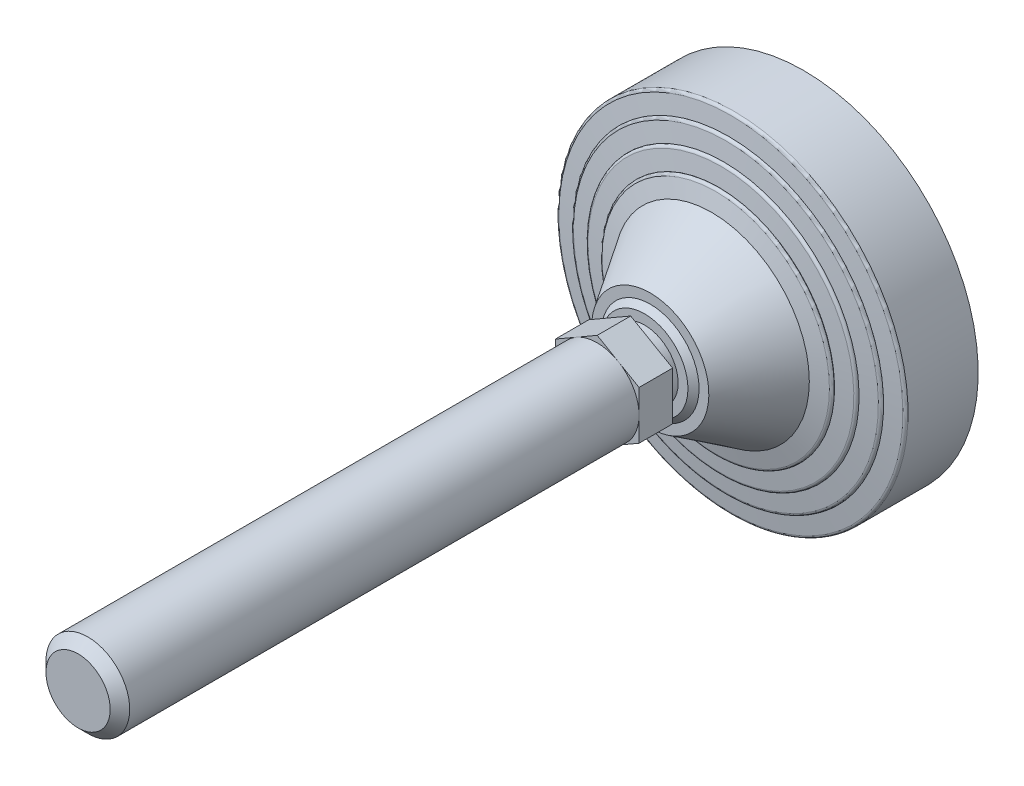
ISO-10303-21;
HEADER;
FILE_DESCRIPTION(('STEP AP214'),'2;1');
FILE_NAME('part.step','',(''),(''),'','','');
FILE_SCHEMA(('AUTOMOTIVE_DESIGN { 1 0 10303 214 1 1 1 1 }'));
ENDSEC;
DATA;
#1=APPLICATION_CONTEXT('core data for automotive mechanical design processes');
#2=APPLICATION_PROTOCOL_DEFINITION('international standard','automotive_design',2000,#1);
#3=PRODUCT_CONTEXT('',#1,'mechanical');
#4=PRODUCT('Part','Part','',(#3));
#5=PRODUCT_RELATED_PRODUCT_CATEGORY('part','',(#4));
#6=PRODUCT_DEFINITION_FORMATION('','',#4);
#7=PRODUCT_DEFINITION_CONTEXT('part definition',#1,'design');
#8=PRODUCT_DEFINITION('design','',#6,#7);
#9=PRODUCT_DEFINITION_SHAPE('','',#8);
#10=(LENGTH_UNIT() NAMED_UNIT(*) SI_UNIT(.MILLI.,.METRE.));
#11=(NAMED_UNIT(*) PLANE_ANGLE_UNIT() SI_UNIT($,.RADIAN.));
#12=(NAMED_UNIT(*) SI_UNIT($,.STERADIAN.) SOLID_ANGLE_UNIT());
#13=UNCERTAINTY_MEASURE_WITH_UNIT(LENGTH_MEASURE(1.E-05),#10,'distance_accuracy_value','');
#14=(GEOMETRIC_REPRESENTATION_CONTEXT(3) GLOBAL_UNCERTAINTY_ASSIGNED_CONTEXT((#13)) GLOBAL_UNIT_ASSIGNED_CONTEXT((#10,
#11,#12)) REPRESENTATION_CONTEXT('',''));
#15=CARTESIAN_POINT('',(0.,0.,0.));
#16=DIRECTION('',(0.,0.,1.));
#17=DIRECTION('',(1.,0.,0.));
#18=AXIS2_PLACEMENT_3D('',#15,#16,#17);
#19=CARTESIAN_POINT('',(-11.9999999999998,0.,62.0000000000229));
#20=DIRECTION('',(0.,0.,1.));
#21=DIRECTION('',(0.,-1.,0.));
#22=AXIS2_PLACEMENT_3D('',#19,#20,#21);
#23=PLANE('',#22);
#24=CARTESIAN_POINT('',(0.,0.,62.0000000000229));
#25=DIRECTION('',(0.,0.,-1.));
#26=DIRECTION('',(0.,1.,0.));
#27=AXIS2_PLACEMENT_3D('',#24,#25,#26);
#28=CIRCLE('',#27,11.9999999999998);
#29=CARTESIAN_POINT('',(0.,11.9999999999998,62.0000000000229));
#30=VERTEX_POINT('',#29);
#31=EDGE_CURVE('E199',#30,#30,#28,.T.);
#32=ORIENTED_EDGE('',*,*,#31,.F.);
#33=EDGE_LOOP('',(#32));
#34=FACE_BOUND('',#33,.T.);
#35=DIRECTION('',(0.866025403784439,0.5,0.));
#36=VECTOR('',#35,1.);
#37=CARTESIAN_POINT('',(-15.,8.6602540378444,62.0000000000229));
#38=LINE('',#37,#36);
#39=CARTESIAN_POINT('',(-15.,8.6602540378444,62.0000000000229));
#40=VERTEX_POINT('',#39);
#41=CARTESIAN_POINT('',(0.,17.3205080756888,62.0000000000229));
#42=VERTEX_POINT('',#41);
#43=EDGE_CURVE('E87',#40,#42,#38,.T.);
#44=ORIENTED_EDGE('',*,*,#43,.T.);
#45=DIRECTION('',(0.866025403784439,-0.5,0.));
#46=VECTOR('',#45,1.);
#47=CARTESIAN_POINT('',(0.,17.3205080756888,62.0000000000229));
#48=LINE('',#47,#46);
#49=CARTESIAN_POINT('',(15.,8.66025403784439,62.0000000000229));
#50=VERTEX_POINT('',#49);
#51=EDGE_CURVE('E99',#42,#50,#48,.T.);
#52=ORIENTED_EDGE('',*,*,#51,.T.);
#53=DIRECTION('',(0.,-1.,0.));
#54=VECTOR('',#53,1.);
#55=CARTESIAN_POINT('',(15.,8.66025403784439,62.0000000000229));
#56=LINE('',#55,#54);
#57=CARTESIAN_POINT('',(15.,-8.66025403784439,62.0000000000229));
#58=VERTEX_POINT('',#57);
#59=EDGE_CURVE('E105',#50,#58,#56,.T.);
#60=ORIENTED_EDGE('',*,*,#59,.T.);
#61=DIRECTION('',(-0.866025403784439,-0.5,0.));
#62=VECTOR('',#61,1.);
#63=CARTESIAN_POINT('',(15.,-8.66025403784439,62.0000000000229));
#64=LINE('',#63,#62);
#65=CARTESIAN_POINT('',(0.,-17.3205080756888,62.0000000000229));
#66=VERTEX_POINT('',#65);
#67=EDGE_CURVE('E113',#58,#66,#64,.T.);
#68=ORIENTED_EDGE('',*,*,#67,.T.);
#69=DIRECTION('',(-0.866025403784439,0.5,0.));
#70=VECTOR('',#69,1.);
#71=CARTESIAN_POINT('',(0.,-17.3205080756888,62.0000000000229));
#72=LINE('',#71,#70);
#73=CARTESIAN_POINT('',(-15.,-8.66025403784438,62.0000000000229));
#74=VERTEX_POINT('',#73);
#75=EDGE_CURVE('E116',#66,#74,#72,.T.);
#76=ORIENTED_EDGE('',*,*,#75,.T.);
#77=DIRECTION('',(0.,1.,0.));
#78=VECTOR('',#77,1.);
#79=CARTESIAN_POINT('',(-15.,-8.66025403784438,62.0000000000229));
#80=LINE('',#79,#78);
#81=EDGE_CURVE('E109',#74,#40,#80,.T.);
#82=ORIENTED_EDGE('',*,*,#81,.T.);
#83=EDGE_LOOP('',(#44,#52,#60,#68,#76,#82));
#84=FACE_BOUND('',#83,.T.);
#85=ADVANCED_FACE('F14',(#34,#84),#23,.F.);
#86=CARTESIAN_POINT('',(0.,0.,0.));
#87=DIRECTION('',(0.,0.,-1.));
#88=DIRECTION('',(0.,1.,0.));
#89=AXIS2_PLACEMENT_3D('',#86,#87,#88);
#90=CYLINDRICAL_SURFACE('',#89,11.9999999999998);
#91=CARTESIAN_POINT('',(0.,0.,57.));
#92=DIRECTION('',(0.,0.,-1.));
#93=DIRECTION('',(0.,1.,0.));
#94=AXIS2_PLACEMENT_3D('',#91,#92,#93);
#95=CIRCLE('',#94,11.9999999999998);
#96=CARTESIAN_POINT('',(0.,11.9999999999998,57.));
#97=VERTEX_POINT('',#96);
#98=EDGE_CURVE('E196',#97,#97,#95,.T.);
#99=ORIENTED_EDGE('',*,*,#98,.F.);
#100=EDGE_LOOP('',(#99));
#101=FACE_BOUND('',#100,.T.);
#102=ORIENTED_EDGE('',*,*,#31,.T.);
#103=EDGE_LOOP('',(#102));
#104=FACE_BOUND('',#103,.T.);
#105=ADVANCED_FACE('F252',(#101,#104),#90,.T.);
#106=CARTESIAN_POINT('',(-11.9999999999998,0.,57.));
#107=DIRECTION('',(0.,0.,-1.));
#108=DIRECTION('',(0.,1.,0.));
#109=AXIS2_PLACEMENT_3D('',#106,#107,#108);
#110=PLANE('',#109);
#111=CARTESIAN_POINT('',(0.,0.,57.));
#112=DIRECTION('',(0.,0.,-1.));
#113=DIRECTION('',(0.,1.,0.));
#114=AXIS2_PLACEMENT_3D('',#111,#112,#113);
#115=CIRCLE('',#114,15.5);
#116=CARTESIAN_POINT('',(0.,15.5,57.));
#117=VERTEX_POINT('',#116);
#118=EDGE_CURVE('E193',#117,#117,#115,.T.);
#119=ORIENTED_EDGE('',*,*,#118,.F.);
#120=EDGE_LOOP('',(#119));
#121=FACE_BOUND('',#120,.T.);
#122=ORIENTED_EDGE('',*,*,#98,.T.);
#123=EDGE_LOOP('',(#122));
#124=FACE_BOUND('',#123,.T.);
#125=ADVANCED_FACE('F258',(#121,#124),#110,.F.);
#126=CARTESIAN_POINT('',(0.,0.,57.));
#127=DIRECTION('',(0.,0.,-1.));
#128=DIRECTION('',(0.,1.,0.));
#129=AXIS2_PLACEMENT_3D('',#126,#127,#128);
#130=CONICAL_SURFACE('',#129,15.5,0.785398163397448);
#131=CARTESIAN_POINT('',(0.,0.,55.));
#132=DIRECTION('',(0.,0.,-1.));
#133=DIRECTION('',(0.,1.,0.));
#134=AXIS2_PLACEMENT_3D('',#131,#132,#133);
#135=CIRCLE('',#134,17.5);
#136=CARTESIAN_POINT('',(0.,17.5,55.));
#137=VERTEX_POINT('',#136);
#138=EDGE_CURVE('E190',#137,#137,#135,.T.);
#139=ORIENTED_EDGE('',*,*,#138,.F.);
#140=EDGE_LOOP('',(#139));
#141=FACE_BOUND('',#140,.T.);
#142=ORIENTED_EDGE('',*,*,#118,.T.);
#143=EDGE_LOOP('',(#142));
#144=FACE_BOUND('',#143,.T.);
#145=ADVANCED_FACE('F265',(#141,#144),#130,.T.);
#146=CARTESIAN_POINT('',(-17.5,0.,55.));
#147=DIRECTION('',(0.,0.,-1.));
#148=DIRECTION('',(0.,1.,0.));
#149=AXIS2_PLACEMENT_3D('',#146,#147,#148);
#150=PLANE('',#149);
#151=CARTESIAN_POINT('',(0.,0.,55.));
#152=DIRECTION('',(0.,0.,-1.));
#153=DIRECTION('',(0.,1.,0.));
#154=AXIS2_PLACEMENT_3D('',#151,#152,#153);
#155=CIRCLE('',#154,20.9999999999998);
#156=CARTESIAN_POINT('',(0.,20.9999999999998,55.));
#157=VERTEX_POINT('',#156);
#158=EDGE_CURVE('E187',#157,#157,#155,.T.);
#159=ORIENTED_EDGE('',*,*,#158,.F.);
#160=EDGE_LOOP('',(#159));
#161=FACE_BOUND('',#160,.T.);
#162=ORIENTED_EDGE('',*,*,#138,.T.);
#163=EDGE_LOOP('',(#162));
#164=FACE_BOUND('',#163,.T.);
#165=ADVANCED_FACE('F269',(#161,#164),#150,.F.);
#166=CARTESIAN_POINT('',(0.,0.,55.));
#167=DIRECTION('',(0.,0.,-1.));
#168=DIRECTION('',(0.,1.,0.));
#169=AXIS2_PLACEMENT_3D('',#166,#167,#168);
#170=CONICAL_SURFACE('',#169,20.9999999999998,0.566729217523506);
#171=CARTESIAN_POINT('',(0.,0.,33.));
#172=DIRECTION('',(0.,0.,-1.));
#173=DIRECTION('',(0.,1.,0.));
#174=AXIS2_PLACEMENT_3D('',#171,#172,#173);
#175=CIRCLE('',#174,35.);
#176=CARTESIAN_POINT('',(0.,35.,33.));
#177=VERTEX_POINT('',#176);
#178=EDGE_CURVE('E184',#177,#177,#175,.T.);
#179=ORIENTED_EDGE('',*,*,#178,.F.);
#180=EDGE_LOOP('',(#179));
#181=FACE_BOUND('',#180,.T.);
#182=ORIENTED_EDGE('',*,*,#158,.T.);
#183=EDGE_LOOP('',(#182));
#184=FACE_BOUND('',#183,.T.);
#185=ADVANCED_FACE('F273',(#181,#184),#170,.T.);
#186=CARTESIAN_POINT('',(0.,0.,33.));
#187=DIRECTION('',(0.,0.,-1.));
#188=DIRECTION('',(0.,1.,0.));
#189=AXIS2_PLACEMENT_3D('',#186,#187,#188);
#190=CONICAL_SURFACE('',#189,35.,1.32154418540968);
#191=CARTESIAN_POINT('',(0.,0.,31.5372089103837));
#192=DIRECTION('',(0.,0.,-1.));
#193=DIRECTION('',(0.,1.,0.));
#194=AXIS2_PLACEMENT_3D('',#191,#192,#193);
#195=CIRCLE('',#194,40.7466792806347);
#196=CARTESIAN_POINT('',(0.,40.7466792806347,31.5372089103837));
#197=VERTEX_POINT('',#196);
#198=EDGE_CURVE('E181',#197,#197,#195,.T.);
#199=ORIENTED_EDGE('',*,*,#198,.F.);
#200=EDGE_LOOP('',(#199));
#201=FACE_BOUND('',#200,.T.);
#202=ORIENTED_EDGE('',*,*,#178,.T.);
#203=EDGE_LOOP('',(#202));
#204=FACE_BOUND('',#203,.T.);
#205=ADVANCED_FACE('F277',(#201,#204),#190,.T.);
#206=CARTESIAN_POINT('',(0.,0.,30.5681117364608));
#207=DIRECTION('',(0.,0.,-1.));
#208=DIRECTION('',(0.,1.,0.));
#209=AXIS2_PLACEMENT_3D('',#206,#207,#208);
#210=TOROIDAL_SURFACE('',#209,40.5,1.);
#211=CARTESIAN_POINT('',(0.,0.,30.5681117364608));
#212=DIRECTION('',(0.,0.,-1.));
#213=DIRECTION('',(0.,1.,0.));
#214=AXIS2_PLACEMENT_3D('',#211,#212,#213);
#215=CIRCLE('',#214,41.5);
#216=CARTESIAN_POINT('',(0.,41.5,30.5681117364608));
#217=VERTEX_POINT('',#216);
#218=EDGE_CURVE('E178',#217,#217,#215,.T.);
#219=ORIENTED_EDGE('',*,*,#218,.F.);
#220=EDGE_LOOP('',(#219));
#221=FACE_BOUND('',#220,.T.);
#222=ORIENTED_EDGE('',*,*,#198,.T.);
#223=EDGE_LOOP('',(#222));
#224=FACE_BOUND('',#223,.T.);
#225=ADVANCED_FACE('F281',(#221,#224),#210,.T.);
#226=CARTESIAN_POINT('',(0.,0.,0.));
#227=DIRECTION('',(0.,0.,-1.));
#228=DIRECTION('',(0.,1.,0.));
#229=AXIS2_PLACEMENT_3D('',#226,#227,#228);
#230=CYLINDRICAL_SURFACE('',#229,41.5);
#231=CARTESIAN_POINT('',(0.,0.,30.4545454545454));
#232=DIRECTION('',(0.,0.,-1.));
#233=DIRECTION('',(0.,1.,0.));
#234=AXIS2_PLACEMENT_3D('',#231,#232,#233);
#235=CIRCLE('',#234,41.5);
#236=CARTESIAN_POINT('',(0.,41.5,30.4545454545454));
#237=VERTEX_POINT('',#236);
#238=EDGE_CURVE('E175',#237,#237,#235,.T.);
#239=ORIENTED_EDGE('',*,*,#238,.F.);
#240=EDGE_LOOP('',(#239));
#241=FACE_BOUND('',#240,.T.);
#242=ORIENTED_EDGE('',*,*,#218,.T.);
#243=EDGE_LOOP('',(#242));
#244=FACE_BOUND('',#243,.T.);
#245=ADVANCED_FACE('F285',(#241,#244),#230,.T.);
#246=CARTESIAN_POINT('',(0.,0.,30.4545454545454));
#247=DIRECTION('',(0.,0.,-1.));
#248=DIRECTION('',(0.,1.,0.));
#249=AXIS2_PLACEMENT_3D('',#246,#247,#248);
#250=CONICAL_SURFACE('',#249,41.5,1.44420419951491);
#251=CARTESIAN_POINT('',(0.,0.,29.674840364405));
#252=DIRECTION('',(0.,0.,-1.));
#253=DIRECTION('',(0.,1.,0.));
#254=AXIS2_PLACEMENT_3D('',#251,#252,#253);
#255=CIRCLE('',#254,47.6262542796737);
#256=CARTESIAN_POINT('',(0.,47.6262542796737,29.674840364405));
#257=VERTEX_POINT('',#256);
#258=EDGE_CURVE('E172',#257,#257,#255,.T.);
#259=ORIENTED_EDGE('',*,*,#258,.F.);
#260=EDGE_LOOP('',(#259));
#261=FACE_BOUND('',#260,.T.);
#262=ORIENTED_EDGE('',*,*,#238,.T.);
#263=EDGE_LOOP('',(#262));
#264=FACE_BOUND('',#263,.T.);
#265=ADVANCED_FACE('F289',(#261,#264),#250,.T.);
#266=CARTESIAN_POINT('',(0.,0.,28.6828424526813));
#267=DIRECTION('',(0.,0.,-1.));
#268=DIRECTION('',(0.,1.,0.));
#269=AXIS2_PLACEMENT_3D('',#266,#267,#268);
#270=TOROIDAL_SURFACE('',#269,47.5,1.);
#271=CARTESIAN_POINT('',(0.,0.,28.6828424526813));
#272=DIRECTION('',(0.,0.,-1.));
#273=DIRECTION('',(0.,1.,0.));
#274=AXIS2_PLACEMENT_3D('',#271,#272,#273);
#275=CIRCLE('',#274,48.5);
#276=CARTESIAN_POINT('',(0.,48.5,28.6828424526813));
#277=VERTEX_POINT('',#276);
#278=EDGE_CURVE('E169',#277,#277,#275,.T.);
#279=ORIENTED_EDGE('',*,*,#278,.F.);
#280=EDGE_LOOP('',(#279));
#281=FACE_BOUND('',#280,.T.);
#282=ORIENTED_EDGE('',*,*,#258,.T.);
#283=EDGE_LOOP('',(#282));
#284=FACE_BOUND('',#283,.T.);
#285=ADVANCED_FACE('F293',(#281,#284),#270,.T.);
#286=CARTESIAN_POINT('',(0.,0.,0.));
#287=DIRECTION('',(0.,0.,-1.));
#288=DIRECTION('',(0.,1.,0.));
#289=AXIS2_PLACEMENT_3D('',#286,#287,#288);
#290=CYLINDRICAL_SURFACE('',#289,48.5);
#291=CARTESIAN_POINT('',(0.,0.,28.6727272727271));
#292=DIRECTION('',(0.,0.,-1.));
#293=DIRECTION('',(0.,1.,0.));
#294=AXIS2_PLACEMENT_3D('',#291,#292,#293);
#295=CIRCLE('',#294,48.5);
#296=CARTESIAN_POINT('',(0.,48.5,28.6727272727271));
#297=VERTEX_POINT('',#296);
#298=EDGE_CURVE('E166',#297,#297,#295,.T.);
#299=ORIENTED_EDGE('',*,*,#298,.F.);
#300=EDGE_LOOP('',(#299));
#301=FACE_BOUND('',#300,.T.);
#302=ORIENTED_EDGE('',*,*,#278,.T.);
#303=EDGE_LOOP('',(#302));
#304=FACE_BOUND('',#303,.T.);
#305=ADVANCED_FACE('F297',(#301,#304),#290,.T.);
#306=CARTESIAN_POINT('',(0.,0.,28.6727272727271));
#307=DIRECTION('',(0.,0.,-1.));
#308=DIRECTION('',(0.,1.,0.));
#309=AXIS2_PLACEMENT_3D('',#306,#307,#308);
#310=CONICAL_SURFACE('',#309,48.5,1.44420419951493);
#311=CARTESIAN_POINT('',(0.,0.,27.8930221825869));
#312=DIRECTION('',(0.,0.,-1.));
#313=DIRECTION('',(0.,1.,0.));
#314=AXIS2_PLACEMENT_3D('',#311,#312,#313);
#315=CIRCLE('',#314,54.6262542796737);
#316=CARTESIAN_POINT('',(0.,54.6262542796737,27.8930221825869));
#317=VERTEX_POINT('',#316);
#318=EDGE_CURVE('E163',#317,#317,#315,.T.);
#319=ORIENTED_EDGE('',*,*,#318,.F.);
#320=EDGE_LOOP('',(#319));
#321=FACE_BOUND('',#320,.T.);
#322=ORIENTED_EDGE('',*,*,#298,.T.);
#323=EDGE_LOOP('',(#322));
#324=FACE_BOUND('',#323,.T.);
#325=ADVANCED_FACE('F301',(#321,#324),#310,.T.);
#326=CARTESIAN_POINT('',(0.,0.,26.9010242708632));
#327=DIRECTION('',(0.,0.,-1.));
#328=DIRECTION('',(0.,1.,0.));
#329=AXIS2_PLACEMENT_3D('',#326,#327,#328);
#330=TOROIDAL_SURFACE('',#329,54.5,1.);
#331=CARTESIAN_POINT('',(0.,0.,26.9010242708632));
#332=DIRECTION('',(0.,0.,-1.));
#333=DIRECTION('',(0.,1.,0.));
#334=AXIS2_PLACEMENT_3D('',#331,#332,#333);
#335=CIRCLE('',#334,55.5);
#336=CARTESIAN_POINT('',(0.,55.5,26.9010242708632));
#337=VERTEX_POINT('',#336);
#338=EDGE_CURVE('E160',#337,#337,#335,.T.);
#339=ORIENTED_EDGE('',*,*,#338,.F.);
#340=EDGE_LOOP('',(#339));
#341=FACE_BOUND('',#340,.T.);
#342=ORIENTED_EDGE('',*,*,#318,.T.);
#343=EDGE_LOOP('',(#342));
#344=FACE_BOUND('',#343,.T.);
#345=ADVANCED_FACE('F305',(#341,#344),#330,.T.);
#346=CARTESIAN_POINT('',(0.,0.,0.));
#347=DIRECTION('',(0.,0.,-1.));
#348=DIRECTION('',(0.,1.,0.));
#349=AXIS2_PLACEMENT_3D('',#346,#347,#348);
#350=CYLINDRICAL_SURFACE('',#349,55.5);
#351=CARTESIAN_POINT('',(0.,0.,26.890909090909));
#352=DIRECTION('',(0.,0.,-1.));
#353=DIRECTION('',(0.,1.,0.));
#354=AXIS2_PLACEMENT_3D('',#351,#352,#353);
#355=CIRCLE('',#354,55.5);
#356=CARTESIAN_POINT('',(0.,55.5,26.890909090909));
#357=VERTEX_POINT('',#356);
#358=EDGE_CURVE('E157',#357,#357,#355,.T.);
#359=ORIENTED_EDGE('',*,*,#358,.F.);
#360=EDGE_LOOP('',(#359));
#361=FACE_BOUND('',#360,.T.);
#362=ORIENTED_EDGE('',*,*,#338,.T.);
#363=EDGE_LOOP('',(#362));
#364=FACE_BOUND('',#363,.T.);
#365=ADVANCED_FACE('F309',(#361,#364),#350,.T.);
#366=CARTESIAN_POINT('',(0.,0.,26.890909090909));
#367=DIRECTION('',(0.,0.,-1.));
#368=DIRECTION('',(0.,1.,0.));
#369=AXIS2_PLACEMENT_3D('',#366,#367,#368);
#370=CONICAL_SURFACE('',#369,55.5,1.44420419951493);
#371=CARTESIAN_POINT('',(0.,0.,26.1112040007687));
#372=DIRECTION('',(0.,0.,-1.));
#373=DIRECTION('',(0.,1.,0.));
#374=AXIS2_PLACEMENT_3D('',#371,#372,#373);
#375=CIRCLE('',#374,61.6262542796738);
#376=CARTESIAN_POINT('',(0.,61.6262542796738,26.1112040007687));
#377=VERTEX_POINT('',#376);
#378=EDGE_CURVE('E154',#377,#377,#375,.T.);
#379=ORIENTED_EDGE('',*,*,#378,.F.);
#380=EDGE_LOOP('',(#379));
#381=FACE_BOUND('',#380,.T.);
#382=ORIENTED_EDGE('',*,*,#358,.T.);
#383=EDGE_LOOP('',(#382));
#384=FACE_BOUND('',#383,.T.);
#385=ADVANCED_FACE('F313',(#381,#384),#370,.T.);
#386=CARTESIAN_POINT('',(0.,0.,25.1192060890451));
#387=DIRECTION('',(0.,0.,-1.));
#388=DIRECTION('',(0.,1.,0.));
#389=AXIS2_PLACEMENT_3D('',#386,#387,#388);
#390=TOROIDAL_SURFACE('',#389,61.5,1.);
#391=CARTESIAN_POINT('',(0.,0.,25.1192060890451));
#392=DIRECTION('',(0.,0.,-1.));
#393=DIRECTION('',(0.,1.,0.));
#394=AXIS2_PLACEMENT_3D('',#391,#392,#393);
#395=CIRCLE('',#394,62.5);
#396=CARTESIAN_POINT('',(0.,62.5,25.1192060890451));
#397=VERTEX_POINT('',#396);
#398=EDGE_CURVE('E151',#397,#397,#395,.T.);
#399=ORIENTED_EDGE('',*,*,#398,.F.);
#400=EDGE_LOOP('',(#399));
#401=FACE_BOUND('',#400,.T.);
#402=ORIENTED_EDGE('',*,*,#378,.T.);
#403=EDGE_LOOP('',(#402));
#404=FACE_BOUND('',#403,.T.);
#405=ADVANCED_FACE('F317',(#401,#404),#390,.T.);
#406=CARTESIAN_POINT('',(0.,0.,0.));
#407=DIRECTION('',(0.,0.,-1.));
#408=DIRECTION('',(0.,1.,0.));
#409=AXIS2_PLACEMENT_3D('',#406,#407,#408);
#410=CYLINDRICAL_SURFACE('',#409,62.5);
#411=CARTESIAN_POINT('',(0.,0.,0.));
#412=DIRECTION('',(0.,0.,-1.));
#413=DIRECTION('',(0.,1.,0.));
#414=AXIS2_PLACEMENT_3D('',#411,#412,#413);
#415=CIRCLE('',#414,62.5);
#416=CARTESIAN_POINT('',(0.,62.5,0.));
#417=VERTEX_POINT('',#416);
#418=EDGE_CURVE('E141',#417,#417,#415,.T.);
#419=ORIENTED_EDGE('',*,*,#418,.F.);
#420=EDGE_LOOP('',(#419));
#421=FACE_BOUND('',#420,.T.);
#422=ORIENTED_EDGE('',*,*,#398,.T.);
#423=EDGE_LOOP('',(#422));
#424=FACE_BOUND('',#423,.T.);
#425=ADVANCED_FACE('F321',(#421,#424),#410,.T.);
#426=CARTESIAN_POINT('',(0.,0.,0.));
#427=DIRECTION('',(0.,0.,1.));
#428=DIRECTION('',(0.,-1.,0.));
#429=AXIS2_PLACEMENT_3D('',#426,#427,#428);
#430=PLANE('',#429);
#431=ORIENTED_EDGE('',*,*,#418,.T.);
#432=EDGE_LOOP('',(#431));
#433=FACE_BOUND('',#432,.T.);
#434=ADVANCED_FACE('F325',(#433),#430,.F.);
#435=CARTESIAN_POINT('',(15.,25.9807621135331,74.0000000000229));
#436=DIRECTION('',(0.,0.,-1.));
#437=DIRECTION('',(0.,1.,0.));
#438=AXIS2_PLACEMENT_3D('',#435,#436,#437);
#439=PLANE('',#438);
#440=DIRECTION('',(0.866025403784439,-0.5,0.));
#441=VECTOR('',#440,1.);
#442=CARTESIAN_POINT('',(0.,17.3205080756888,74.0000000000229));
#443=LINE('',#442,#441);
#444=CARTESIAN_POINT('',(7.5,12.9903810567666,74.0000000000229));
#445=VERTEX_POINT('',#444);
#446=CARTESIAN_POINT('',(15.,8.66025403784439,74.0000000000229));
#447=VERTEX_POINT('',#446);
#448=EDGE_CURVE('E121',#445,#447,#443,.T.);
#449=ORIENTED_EDGE('',*,*,#448,.F.);
#450=CARTESIAN_POINT('',(0.,0.,74.0000000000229));
#451=DIRECTION('',(0.,0.,-1.));
#452=DIRECTION('',(0.,1.,0.));
#453=AXIS2_PLACEMENT_3D('',#450,#451,#452);
#454=CIRCLE('',#453,14.9999999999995);
#455=CARTESIAN_POINT('',(15.,0.,74.0000000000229));
#456=VERTEX_POINT('',#455);
#457=EDGE_CURVE('E9',#445,#456,#454,.T.);
#458=ORIENTED_EDGE('',*,*,#457,.T.);
#459=DIRECTION('',(0.,-1.,0.));
#460=VECTOR('',#459,1.);
#461=CARTESIAN_POINT('',(15.,8.66025403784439,74.0000000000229));
#462=LINE('',#461,#460);
#463=EDGE_CURVE('E125',#447,#456,#462,.T.);
#464=ORIENTED_EDGE('',*,*,#463,.F.);
#465=EDGE_LOOP('',(#449,#458,#464));
#466=FACE_BOUND('',#465,.T.);
#467=ADVANCED_FACE('F238',(#466),#439,.F.);
#468=CARTESIAN_POINT('',(15.,-8.66025403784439,74.0000000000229));
#469=VERTEX_POINT('',#468);
#470=EDGE_CURVE('E124',#456,#469,#462,.T.);
#471=ORIENTED_EDGE('',*,*,#470,.F.);
#472=CARTESIAN_POINT('',(7.5,-12.9903810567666,74.0000000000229));
#473=VERTEX_POINT('',#472);
#474=EDGE_CURVE('E23',#456,#473,#454,.T.);
#475=ORIENTED_EDGE('',*,*,#474,.T.);
#476=DIRECTION('',(-0.866025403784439,-0.5,0.));
#477=VECTOR('',#476,1.);
#478=CARTESIAN_POINT('',(15.,-8.66025403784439,74.0000000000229));
#479=LINE('',#478,#477);
#480=EDGE_CURVE('E129',#469,#473,#479,.T.);
#481=ORIENTED_EDGE('',*,*,#480,.F.);
#482=EDGE_LOOP('',(#471,#475,#481));
#483=FACE_BOUND('',#482,.T.);
#484=ADVANCED_FACE('F227',(#483),#439,.F.);
#485=CARTESIAN_POINT('',(0.,-17.3205080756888,74.0000000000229));
#486=VERTEX_POINT('',#485);
#487=EDGE_CURVE('E128',#473,#486,#479,.T.);
#488=ORIENTED_EDGE('',*,*,#487,.F.);
#489=CARTESIAN_POINT('',(-7.5,-12.9903810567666,74.0000000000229));
#490=VERTEX_POINT('',#489);
#491=EDGE_CURVE('E33',#473,#490,#454,.T.);
#492=ORIENTED_EDGE('',*,*,#491,.T.);
#493=DIRECTION('',(-0.866025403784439,0.5,0.));
#494=VECTOR('',#493,1.);
#495=CARTESIAN_POINT('',(0.,-17.3205080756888,74.0000000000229));
#496=LINE('',#495,#494);
#497=EDGE_CURVE('E133',#486,#490,#496,.T.);
#498=ORIENTED_EDGE('',*,*,#497,.F.);
#499=EDGE_LOOP('',(#488,#492,#498));
#500=FACE_BOUND('',#499,.T.);
#501=ADVANCED_FACE('F228',(#500),#439,.F.);
#502=CARTESIAN_POINT('',(-15.,-8.66025403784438,74.0000000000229));
#503=VERTEX_POINT('',#502);
#504=EDGE_CURVE('E132',#490,#503,#496,.T.);
#505=ORIENTED_EDGE('',*,*,#504,.F.);
#506=CARTESIAN_POINT('',(-15.,0.,74.0000000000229));
#507=VERTEX_POINT('',#506);
#508=EDGE_CURVE('E213',#490,#507,#454,.T.);
#509=ORIENTED_EDGE('',*,*,#508,.T.);
#510=DIRECTION('',(0.,1.,0.));
#511=VECTOR('',#510,1.);
#512=CARTESIAN_POINT('',(-15.,-8.66025403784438,74.0000000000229));
#513=LINE('',#512,#511);
#514=EDGE_CURVE('E96',#503,#507,#513,.T.);
#515=ORIENTED_EDGE('',*,*,#514,.F.);
#516=EDGE_LOOP('',(#505,#509,#515));
#517=FACE_BOUND('',#516,.T.);
#518=ADVANCED_FACE('F358',(#517),#439,.F.);
#519=CARTESIAN_POINT('',(-15.,8.6602540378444,74.0000000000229));
#520=VERTEX_POINT('',#519);
#521=EDGE_CURVE('E136',#507,#520,#513,.T.);
#522=ORIENTED_EDGE('',*,*,#521,.F.);
#523=CARTESIAN_POINT('',(-7.5,12.9903810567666,74.0000000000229));
#524=VERTEX_POINT('',#523);
#525=EDGE_CURVE('E209',#507,#524,#454,.T.);
#526=ORIENTED_EDGE('',*,*,#525,.T.);
#527=DIRECTION('',(0.866025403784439,0.5,0.));
#528=VECTOR('',#527,1.);
#529=CARTESIAN_POINT('',(-15.,8.6602540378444,74.0000000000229));
#530=LINE('',#529,#528);
#531=EDGE_CURVE('E119',#520,#524,#530,.T.);
#532=ORIENTED_EDGE('',*,*,#531,.F.);
#533=EDGE_LOOP('',(#522,#526,#532));
#534=FACE_BOUND('',#533,.T.);
#535=ADVANCED_FACE('F353',(#534),#439,.F.);
#536=CARTESIAN_POINT('',(0.,17.3205080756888,74.0000000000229));
#537=VERTEX_POINT('',#536);
#538=EDGE_CURVE('E91',#524,#537,#530,.T.);
#539=ORIENTED_EDGE('',*,*,#538,.F.);
#540=EDGE_CURVE('E18',#524,#445,#454,.T.);
#541=ORIENTED_EDGE('',*,*,#540,.T.);
#542=EDGE_CURVE('E122',#537,#445,#443,.T.);
#543=ORIENTED_EDGE('',*,*,#542,.F.);
#544=EDGE_LOOP('',(#539,#541,#543));
#545=FACE_BOUND('',#544,.T.);
#546=ADVANCED_FACE('F333',(#545),#439,.F.);
#547=CARTESIAN_POINT('',(-15.,8.6602540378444,74.0000000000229));
#548=DIRECTION('',(-0.5,0.866025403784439,0.));
#549=DIRECTION('',(-0.866025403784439,-0.5,0.));
#550=AXIS2_PLACEMENT_3D('',#547,#548,#549);
#551=PLANE('',#550);
#552=ORIENTED_EDGE('',*,*,#43,.F.);
#553=DIRECTION('',(0.,0.,-1.));
#554=VECTOR('',#553,1.);
#555=CARTESIAN_POINT('',(-15.,8.6602540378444,74.0000000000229));
#556=LINE('',#555,#554);
#557=EDGE_CURVE('E139',#520,#40,#556,.T.);
#558=ORIENTED_EDGE('',*,*,#557,.F.);
#559=ORIENTED_EDGE('',*,*,#531,.T.);
#560=ORIENTED_EDGE('',*,*,#538,.T.);
#561=DIRECTION('',(0.,0.,-1.));
#562=VECTOR('',#561,1.);
#563=CARTESIAN_POINT('',(0.,17.3205080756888,74.0000000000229));
#564=LINE('',#563,#562);
#565=EDGE_CURVE('E82',#537,#42,#564,.T.);
#566=ORIENTED_EDGE('',*,*,#565,.T.);
#567=EDGE_LOOP('',(#552,#558,#559,#560,#566));
#568=FACE_BOUND('',#567,.T.);
#569=ADVANCED_FACE('F84',(#568),#551,.T.);
#570=CARTESIAN_POINT('',(-15.,-8.66025403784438,74.0000000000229));
#571=DIRECTION('',(-1.,0.,0.));
#572=DIRECTION('',(0.,-1.,0.));
#573=AXIS2_PLACEMENT_3D('',#570,#571,#572);
#574=PLANE('',#573);
#575=ORIENTED_EDGE('',*,*,#81,.F.);
#576=DIRECTION('',(0.,0.,-1.));
#577=VECTOR('',#576,1.);
#578=CARTESIAN_POINT('',(-15.,-8.66025403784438,74.0000000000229));
#579=LINE('',#578,#577);
#580=EDGE_CURVE('E142',#503,#74,#579,.T.);
#581=ORIENTED_EDGE('',*,*,#580,.F.);
#582=ORIENTED_EDGE('',*,*,#514,.T.);
#583=ORIENTED_EDGE('',*,*,#521,.T.);
#584=ORIENTED_EDGE('',*,*,#557,.T.);
#585=EDGE_LOOP('',(#575,#581,#582,#583,#584));
#586=FACE_BOUND('',#585,.T.);
#587=ADVANCED_FACE('F332',(#586),#574,.T.);
#588=CARTESIAN_POINT('',(0.,-17.3205080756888,74.0000000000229));
#589=DIRECTION('',(-0.5,-0.866025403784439,0.));
#590=DIRECTION('',(0.866025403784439,-0.5,0.));
#591=AXIS2_PLACEMENT_3D('',#588,#589,#590);
#592=PLANE('',#591);
#593=ORIENTED_EDGE('',*,*,#75,.F.);
#594=DIRECTION('',(0.,0.,-1.));
#595=VECTOR('',#594,1.);
#596=CARTESIAN_POINT('',(0.,-17.3205080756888,74.0000000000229));
#597=LINE('',#596,#595);
#598=EDGE_CURVE('E144',#486,#66,#597,.T.);
#599=ORIENTED_EDGE('',*,*,#598,.F.);
#600=ORIENTED_EDGE('',*,*,#497,.T.);
#601=ORIENTED_EDGE('',*,*,#504,.T.);
#602=ORIENTED_EDGE('',*,*,#580,.T.);
#603=EDGE_LOOP('',(#593,#599,#600,#601,#602));
#604=FACE_BOUND('',#603,.T.);
#605=ADVANCED_FACE('F340',(#604),#592,.T.);
#606=CARTESIAN_POINT('',(15.,-8.66025403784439,74.0000000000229));
#607=DIRECTION('',(0.5,-0.866025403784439,0.));
#608=DIRECTION('',(0.866025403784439,0.5,0.));
#609=AXIS2_PLACEMENT_3D('',#606,#607,#608);
#610=PLANE('',#609);
#611=ORIENTED_EDGE('',*,*,#67,.F.);
#612=DIRECTION('',(0.,0.,-1.));
#613=VECTOR('',#612,1.);
#614=CARTESIAN_POINT('',(15.,-8.66025403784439,74.0000000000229));
#615=LINE('',#614,#613);
#616=EDGE_CURVE('E146',#469,#58,#615,.T.);
#617=ORIENTED_EDGE('',*,*,#616,.F.);
#618=ORIENTED_EDGE('',*,*,#480,.T.);
#619=ORIENTED_EDGE('',*,*,#487,.T.);
#620=ORIENTED_EDGE('',*,*,#598,.T.);
#621=EDGE_LOOP('',(#611,#617,#618,#619,#620));
#622=FACE_BOUND('',#621,.T.);
#623=ADVANCED_FACE('F233',(#622),#610,.T.);
#624=CARTESIAN_POINT('',(15.,8.66025403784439,74.0000000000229));
#625=DIRECTION('',(1.,0.,0.));
#626=DIRECTION('',(0.,1.,0.));
#627=AXIS2_PLACEMENT_3D('',#624,#625,#626);
#628=PLANE('',#627);
#629=ORIENTED_EDGE('',*,*,#59,.F.);
#630=DIRECTION('',(0.,0.,-1.));
#631=VECTOR('',#630,1.);
#632=CARTESIAN_POINT('',(15.,8.66025403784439,74.0000000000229));
#633=LINE('',#632,#631);
#634=EDGE_CURVE('E95',#447,#50,#633,.T.);
#635=ORIENTED_EDGE('',*,*,#634,.F.);
#636=ORIENTED_EDGE('',*,*,#463,.T.);
#637=ORIENTED_EDGE('',*,*,#470,.T.);
#638=ORIENTED_EDGE('',*,*,#616,.T.);
#639=EDGE_LOOP('',(#629,#635,#636,#637,#638));
#640=FACE_BOUND('',#639,.T.);
#641=ADVANCED_FACE('F235',(#640),#628,.T.);
#642=CARTESIAN_POINT('',(0.,17.3205080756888,74.0000000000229));
#643=DIRECTION('',(0.5,0.866025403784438,0.));
#644=DIRECTION('',(-0.866025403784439,0.5,0.));
#645=AXIS2_PLACEMENT_3D('',#642,#643,#644);
#646=PLANE('',#645);
#647=ORIENTED_EDGE('',*,*,#51,.F.);
#648=ORIENTED_EDGE('',*,*,#565,.F.);
#649=ORIENTED_EDGE('',*,*,#542,.T.);
#650=ORIENTED_EDGE('',*,*,#448,.T.);
#651=ORIENTED_EDGE('',*,*,#634,.T.);
#652=EDGE_LOOP('',(#647,#648,#649,#650,#651));
#653=FACE_BOUND('',#652,.T.);
#654=ADVANCED_FACE('F100',(#653),#646,.T.);
#655=CARTESIAN_POINT('',(-11.4999999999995,0.,260.));
#656=DIRECTION('',(0.,0.,-1.));
#657=DIRECTION('',(0.,1.,0.));
#658=AXIS2_PLACEMENT_3D('',#655,#656,#657);
#659=PLANE('',#658);
#660=CARTESIAN_POINT('',(0.,0.,260.));
#661=DIRECTION('',(0.,0.,-1.));
#662=DIRECTION('',(0.,1.,0.));
#663=AXIS2_PLACEMENT_3D('',#660,#661,#662);
#664=CIRCLE('',#663,11.4999999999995);
#665=CARTESIAN_POINT('',(0.,11.4999999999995,260.));
#666=VERTEX_POINT('',#665);
#667=EDGE_CURVE('E204',#666,#666,#664,.T.);
#668=ORIENTED_EDGE('',*,*,#667,.F.);
#669=EDGE_LOOP('',(#668));
#670=FACE_BOUND('',#669,.T.);
#671=ADVANCED_FACE('F16',(#670),#659,.F.);
#672=CARTESIAN_POINT('',(0.,0.,260.));
#673=DIRECTION('',(0.,0.,-1.));
#674=DIRECTION('',(0.,1.,0.));
#675=AXIS2_PLACEMENT_3D('',#672,#673,#674);
#676=CONICAL_SURFACE('',#675,11.4999999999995,0.785398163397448);
#677=CARTESIAN_POINT('',(0.,0.,256.5));
#678=DIRECTION('',(0.,0.,-1.));
#679=DIRECTION('',(0.,1.,0.));
#680=AXIS2_PLACEMENT_3D('',#677,#678,#679);
#681=CIRCLE('',#680,14.9999999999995);
#682=CARTESIAN_POINT('',(0.,14.9999999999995,256.5));
#683=VERTEX_POINT('',#682);
#684=EDGE_CURVE('E202',#683,#683,#681,.T.);
#685=ORIENTED_EDGE('',*,*,#684,.F.);
#686=EDGE_LOOP('',(#685));
#687=FACE_BOUND('',#686,.T.);
#688=ORIENTED_EDGE('',*,*,#667,.T.);
#689=EDGE_LOOP('',(#688));
#690=FACE_BOUND('',#689,.T.);
#691=ADVANCED_FACE('F241',(#687,#690),#676,.T.);
#692=CARTESIAN_POINT('',(0.,0.,0.));
#693=DIRECTION('',(0.,0.,-1.));
#694=DIRECTION('',(0.,1.,0.));
#695=AXIS2_PLACEMENT_3D('',#692,#693,#694);
#696=CYLINDRICAL_SURFACE('',#695,14.9999999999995);
#697=ORIENTED_EDGE('',*,*,#684,.T.);
#698=EDGE_LOOP('',(#697));
#699=FACE_BOUND('',#698,.T.);
#700=ORIENTED_EDGE('',*,*,#457,.F.);
#701=ORIENTED_EDGE('',*,*,#540,.F.);
#702=ORIENTED_EDGE('',*,*,#525,.F.);
#703=ORIENTED_EDGE('',*,*,#508,.F.);
#704=ORIENTED_EDGE('',*,*,#491,.F.);
#705=ORIENTED_EDGE('',*,*,#474,.F.);
#706=EDGE_LOOP('',(#700,#701,#702,#703,#704,#705));
#707=FACE_BOUND('',#706,.T.);
#708=ADVANCED_FACE('F239',(#699,#707),#696,.T.);
#709=CLOSED_SHELL('',(#85,#105,#125,#145,#165,#185,#205,#225,#245,#265,#285,#305,#325,#345,#365,
#385,#405,#425,#434,#467,#484,#501,#518,#535,#546,#569,#587,#605,#623,#641,#654,#671,#691,#708));
#710=MANIFOLD_SOLID_BREP('B1',#709);
#711=ADVANCED_BREP_SHAPE_REPRESENTATION('',(#18,#710),#14);
#712=SHAPE_DEFINITION_REPRESENTATION(#9,#711);
ENDSEC;
END-ISO-10303-21;
